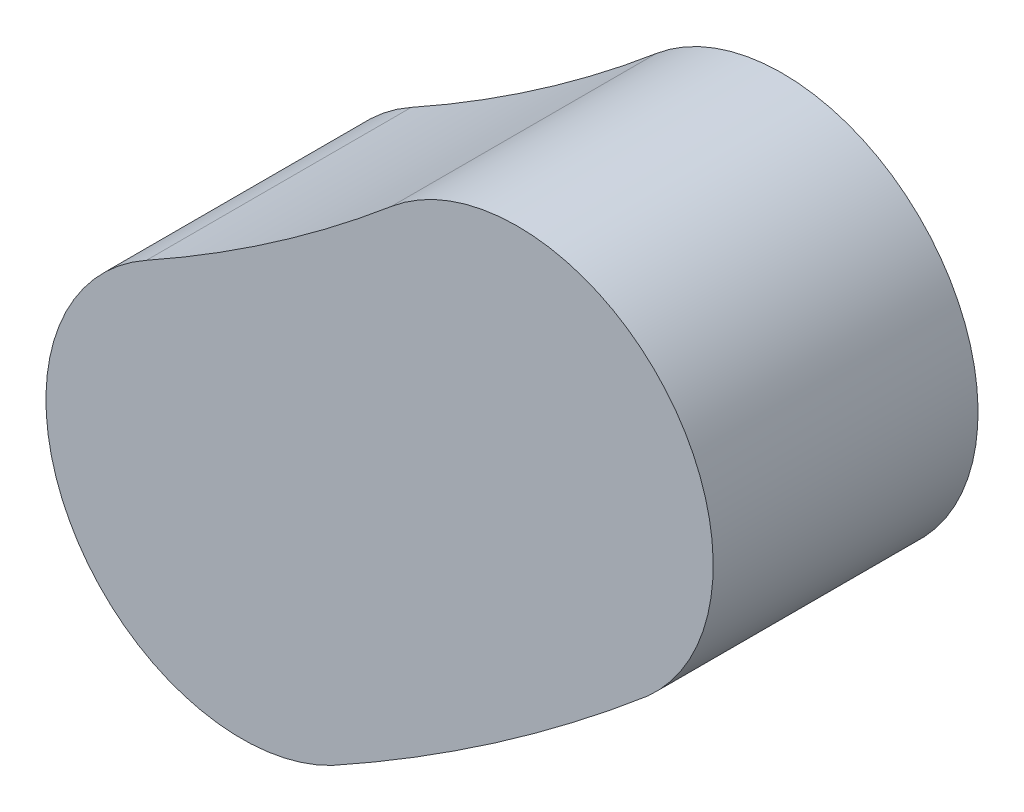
from build123d import *

# Parameters (mm, degrees)
BOSS_EXTRUDE1_DEPTH = 8


with BuildPart() as part:
    # Sketch2 → Boss-Extrude1 (new body)
    with BuildSketch(Plane.XY):
        with BuildLine():
            ThreePointArc((30.214955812, 54.972647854), (26.639449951, 52.241734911), (22.818658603, 49.866091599))
            ThreePointArc((22.818658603, 49.866091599), (20.489853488, 41.898243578), (28.423187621, 39.454446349))
            ThreePointArc((28.423187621, 39.454446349), (33.216088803, 42.415193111), (37.703149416, 45.821688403))
            ThreePointArc((37.703149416, 45.821688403), (37.834076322, 45.931699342), (37.964682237, 46.042091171))
            ThreePointArc((37.964682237, 46.042091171), (38.490978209, 54.326591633), (30.214955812, 54.972647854))
        make_face()
    extrude(amount=BOSS_EXTRUDE1_DEPTH)


solid = part.part
